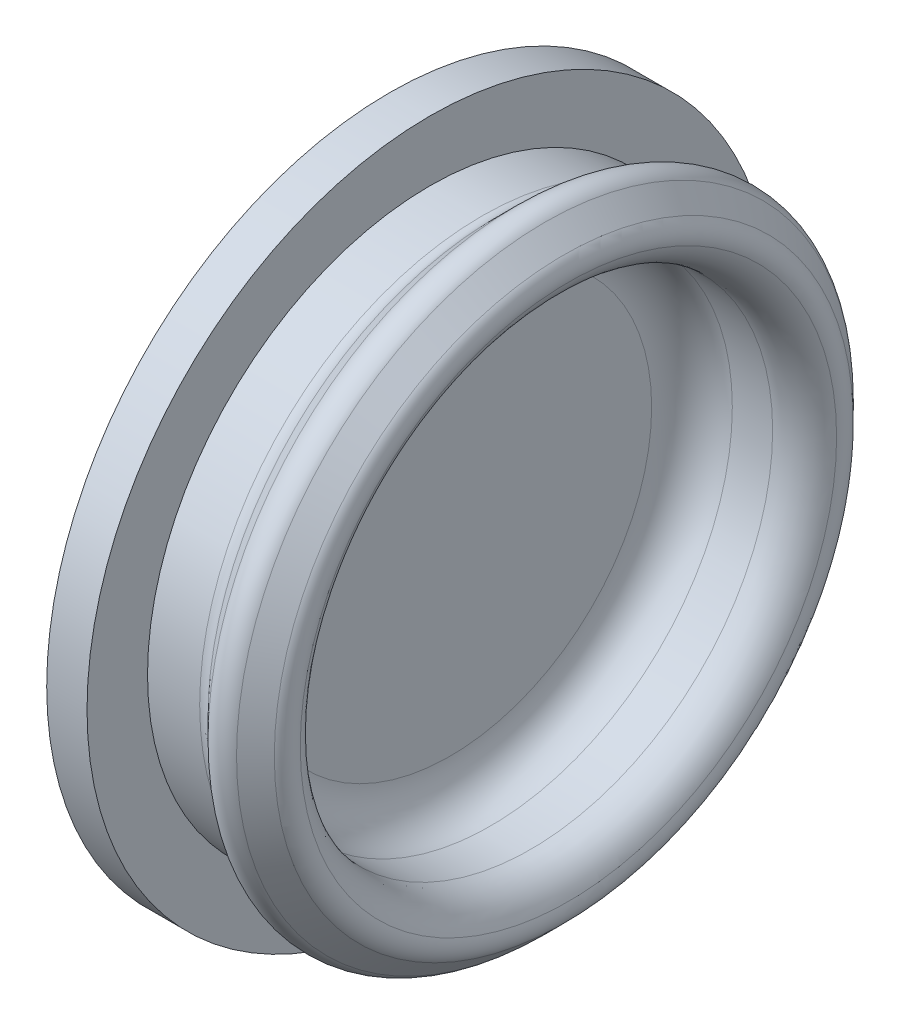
ISO-10303-21;
HEADER;
FILE_DESCRIPTION(('STEP AP214'),'2;1');
FILE_NAME('part.step','',(''),(''),'','','');
FILE_SCHEMA(('AUTOMOTIVE_DESIGN { 1 0 10303 214 1 1 1 1 }'));
ENDSEC;
DATA;
#1=APPLICATION_CONTEXT('core data for automotive mechanical design processes');
#2=APPLICATION_PROTOCOL_DEFINITION('international standard','automotive_design',2000,#1);
#3=PRODUCT_CONTEXT('',#1,'mechanical');
#4=PRODUCT('Part','Part','',(#3));
#5=PRODUCT_RELATED_PRODUCT_CATEGORY('part','',(#4));
#6=PRODUCT_DEFINITION_FORMATION('','',#4);
#7=PRODUCT_DEFINITION_CONTEXT('part definition',#1,'design');
#8=PRODUCT_DEFINITION('design','',#6,#7);
#9=PRODUCT_DEFINITION_SHAPE('','',#8);
#10=(LENGTH_UNIT() NAMED_UNIT(*) SI_UNIT(.MILLI.,.METRE.));
#11=(NAMED_UNIT(*) PLANE_ANGLE_UNIT() SI_UNIT($,.RADIAN.));
#12=(NAMED_UNIT(*) SI_UNIT($,.STERADIAN.) SOLID_ANGLE_UNIT());
#13=UNCERTAINTY_MEASURE_WITH_UNIT(LENGTH_MEASURE(1.E-05),#10,'distance_accuracy_value','');
#14=(GEOMETRIC_REPRESENTATION_CONTEXT(3) GLOBAL_UNCERTAINTY_ASSIGNED_CONTEXT((#13)) GLOBAL_UNIT_ASSIGNED_CONTEXT((#10,
#11,#12)) REPRESENTATION_CONTEXT('',''));
#15=CARTESIAN_POINT('',(0.,0.,0.));
#16=DIRECTION('',(0.,0.,1.));
#17=DIRECTION('',(1.,0.,0.));
#18=AXIS2_PLACEMENT_3D('',#15,#16,#17);
#19=CARTESIAN_POINT('',(-98.2502746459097,31.6895515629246,62.9087422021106));
#20=DIRECTION('',(-1.,0.,0.));
#21=DIRECTION('',(0.,-1.,0.));
#22=AXIS2_PLACEMENT_3D('',#19,#20,#21);
#23=CYLINDRICAL_SURFACE('',#22,7.);
#24=CARTESIAN_POINT('',(-98.4573814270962,31.6895515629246,62.9087422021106));
#25=DIRECTION('',(1.,0.,0.));
#26=DIRECTION('',(0.,1.,0.));
#27=AXIS2_PLACEMENT_3D('',#24,#25,#26);
#28=CIRCLE('',#27,7.);
#29=CARTESIAN_POINT('',(-98.4573814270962,38.6895515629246,62.9087422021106));
#30=VERTEX_POINT('',#29);
#31=EDGE_CURVE('E10',#30,#30,#28,.F.);
#32=ORIENTED_EDGE('',*,*,#31,.T.);
#33=EDGE_LOOP('',(#32));
#34=FACE_BOUND('',#33,.T.);
#35=CARTESIAN_POINT('',(-99.7502746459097,31.6895515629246,62.9087422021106));
#36=DIRECTION('',(-1.,0.,0.));
#37=DIRECTION('',(0.,-1.,0.));
#38=AXIS2_PLACEMENT_3D('',#35,#36,#37);
#39=CIRCLE('',#38,7.);
#40=CARTESIAN_POINT('',(-99.7502746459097,24.6895515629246,62.9087422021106));
#41=VERTEX_POINT('',#40);
#42=EDGE_CURVE('E70',#41,#41,#39,.T.);
#43=ORIENTED_EDGE('',*,*,#42,.F.);
#44=EDGE_LOOP('',(#43));
#45=FACE_BOUND('',#44,.T.);
#46=ADVANCED_FACE('F35',(#34,#45),#23,.T.);
#47=CARTESIAN_POINT('',(-100.75027464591,31.6895515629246,62.9087422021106));
#48=DIRECTION('',(1.,0.,0.));
#49=DIRECTION('',(0.,1.,0.));
#50=AXIS2_PLACEMENT_3D('',#47,#48,#49);
#51=CYLINDRICAL_SURFACE('',#50,8.50000000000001);
#52=CARTESIAN_POINT('',(-100.75027464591,31.6895515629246,62.9087422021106));
#53=DIRECTION('',(-1.,0.,0.));
#54=DIRECTION('',(0.,-1.,0.));
#55=AXIS2_PLACEMENT_3D('',#52,#53,#54);
#56=CIRCLE('',#55,8.50000000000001);
#57=CARTESIAN_POINT('',(-100.75027464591,23.1895515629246,62.9087422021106));
#58=VERTEX_POINT('',#57);
#59=EDGE_CURVE('E73',#58,#58,#56,.T.);
#60=ORIENTED_EDGE('',*,*,#59,.F.);
#61=EDGE_LOOP('',(#60));
#62=FACE_BOUND('',#61,.T.);
#63=CARTESIAN_POINT('',(-99.7502746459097,31.6895515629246,62.9087422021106));
#64=DIRECTION('',(-1.,0.,0.));
#65=DIRECTION('',(0.,-1.,0.));
#66=AXIS2_PLACEMENT_3D('',#63,#64,#65);
#67=CIRCLE('',#66,8.50000000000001);
#68=CARTESIAN_POINT('',(-99.7502746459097,23.1895515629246,62.9087422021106));
#69=VERTEX_POINT('',#68);
#70=EDGE_CURVE('E74',#69,#69,#67,.T.);
#71=ORIENTED_EDGE('',*,*,#70,.T.);
#72=EDGE_LOOP('',(#71));
#73=FACE_BOUND('',#72,.T.);
#74=ADVANCED_FACE('F82',(#62,#73),#51,.T.);
#75=CARTESIAN_POINT('',(-100.75027464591,31.6895515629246,62.9087422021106));
#76=DIRECTION('',(-1.,0.,0.));
#77=DIRECTION('',(0.,-1.,0.));
#78=AXIS2_PLACEMENT_3D('',#75,#76,#77);
#79=PLANE('',#78);
#80=ORIENTED_EDGE('',*,*,#59,.T.);
#81=EDGE_LOOP('',(#80));
#82=FACE_BOUND('',#81,.T.);
#83=ADVANCED_FACE('F80',(#82),#79,.T.);
#84=CARTESIAN_POINT('',(-99.7502746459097,31.6895515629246,62.9087422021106));
#85=DIRECTION('',(-1.,0.,0.));
#86=DIRECTION('',(0.,-1.,0.));
#87=AXIS2_PLACEMENT_3D('',#84,#85,#86);
#88=PLANE('',#87);
#89=ORIENTED_EDGE('',*,*,#42,.T.);
#90=EDGE_LOOP('',(#89));
#91=FACE_BOUND('',#90,.T.);
#92=ORIENTED_EDGE('',*,*,#70,.F.);
#93=EDGE_LOOP('',(#92));
#94=FACE_BOUND('',#93,.T.);
#95=ADVANCED_FACE('F88',(#91,#94),#88,.F.);
#96=CARTESIAN_POINT('',(-97.2502746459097,31.6895515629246,62.9087422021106));
#97=DIRECTION('',(-1.,0.,0.));
#98=DIRECTION('',(0.,0.,1.));
#99=AXIS2_PLACEMENT_3D('',#96,#97,#98);
#100=CONICAL_SURFACE('',#99,8.,0.785398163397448);
#101=CARTESIAN_POINT('',(-96.4284775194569,31.6895515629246,62.9087422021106));
#102=DIRECTION('',(-1.,0.,0.));
#103=DIRECTION('',(0.,0.,1.));
#104=AXIS2_PLACEMENT_3D('',#101,#102,#103);
#105=CIRCLE('',#104,7.17820287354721);
#106=CARTESIAN_POINT('',(-96.4284775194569,31.6895515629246,70.0869450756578));
#107=VERTEX_POINT('',#106);
#108=EDGE_CURVE('E50',#107,#107,#105,.T.);
#109=ORIENTED_EDGE('',*,*,#108,.T.);
#110=EDGE_LOOP('',(#109));
#111=FACE_BOUND('',#110,.T.);
#112=CARTESIAN_POINT('',(-96.8967212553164,31.6895515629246,62.9087422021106));
#113=DIRECTION('',(1.,0.,0.));
#114=DIRECTION('',(0.,0.,-1.));
#115=AXIS2_PLACEMENT_3D('',#112,#113,#114);
#116=CIRCLE('',#115,7.64644660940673);
#117=CARTESIAN_POINT('',(-96.8967212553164,31.6895515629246,55.2622955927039));
#118=VERTEX_POINT('',#117);
#119=EDGE_CURVE('E55',#118,#118,#116,.T.);
#120=ORIENTED_EDGE('',*,*,#119,.T.);
#121=EDGE_LOOP('',(#120));
#122=FACE_BOUND('',#121,.T.);
#123=ADVANCED_FACE('F90',(#111,#122),#100,.T.);
#124=CARTESIAN_POINT('',(-98.2502746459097,31.6895515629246,62.9087422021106));
#125=DIRECTION('',(1.,0.,0.));
#126=DIRECTION('',(0.,0.,-1.));
#127=AXIS2_PLACEMENT_3D('',#124,#125,#126);
#128=CONICAL_SURFACE('',#127,7.,0.785398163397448);
#129=CARTESIAN_POINT('',(-98.103828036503,31.6895515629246,62.9087422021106));
#130=DIRECTION('',(-1.,0.,0.));
#131=DIRECTION('',(0.,-1.,0.));
#132=AXIS2_PLACEMENT_3D('',#129,#130,#131);
#133=CIRCLE('',#132,7.14644660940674);
#134=CARTESIAN_POINT('',(-98.103828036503,24.5431049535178,62.9087422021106));
#135=VERTEX_POINT('',#134);
#136=EDGE_CURVE('E42',#135,#135,#133,.F.);
#137=ORIENTED_EDGE('',*,*,#136,.T.);
#138=EDGE_LOOP('',(#137));
#139=FACE_BOUND('',#138,.T.);
#140=CARTESIAN_POINT('',(-97.603828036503,31.6895515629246,62.9087422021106));
#141=DIRECTION('',(-1.,0.,0.));
#142=DIRECTION('',(0.,0.,1.));
#143=AXIS2_PLACEMENT_3D('',#140,#141,#142);
#144=CIRCLE('',#143,7.64644660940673);
#145=CARTESIAN_POINT('',(-97.603828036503,31.6895515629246,70.5551888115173));
#146=VERTEX_POINT('',#145);
#147=EDGE_CURVE('E46',#146,#146,#144,.T.);
#148=ORIENTED_EDGE('',*,*,#147,.T.);
#149=EDGE_LOOP('',(#148));
#150=FACE_BOUND('',#149,.T.);
#151=ADVANCED_FACE('F98',(#139,#150),#128,.T.);
#152=CARTESIAN_POINT('',(-99.2502746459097,31.6895515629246,62.9087422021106));
#153=DIRECTION('',(1.,0.,0.));
#154=DIRECTION('',(0.,0.,-1.));
#155=AXIS2_PLACEMENT_3D('',#152,#153,#154);
#156=CYLINDRICAL_SURFACE('',#155,6.);
#157=CARTESIAN_POINT('',(-98.2502746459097,31.6895515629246,62.9087422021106));
#158=DIRECTION('',(1.,0.,0.));
#159=DIRECTION('',(0.,0.,-1.));
#160=AXIS2_PLACEMENT_3D('',#157,#158,#159);
#161=CIRCLE('',#160,6.);
#162=CARTESIAN_POINT('',(-98.2502746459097,31.6895515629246,56.9087422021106));
#163=VERTEX_POINT('',#162);
#164=EDGE_CURVE('E61',#163,#163,#161,.F.);
#165=ORIENTED_EDGE('',*,*,#164,.T.);
#166=EDGE_LOOP('',(#165));
#167=FACE_BOUND('',#166,.T.);
#168=CARTESIAN_POINT('',(-97.2502746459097,31.6895515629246,62.9087422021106));
#169=DIRECTION('',(-1.,0.,0.));
#170=DIRECTION('',(0.,0.,1.));
#171=AXIS2_PLACEMENT_3D('',#168,#169,#170);
#172=CIRCLE('',#171,6.);
#173=CARTESIAN_POINT('',(-97.2502746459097,31.6895515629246,68.9087422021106));
#174=VERTEX_POINT('',#173);
#175=EDGE_CURVE('E64',#174,#174,#172,.F.);
#176=ORIENTED_EDGE('',*,*,#175,.T.);
#177=EDGE_LOOP('',(#176));
#178=FACE_BOUND('',#177,.T.);
#179=ADVANCED_FACE('F137',(#167,#178),#156,.F.);
#180=CARTESIAN_POINT('',(-99.2502746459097,31.6895515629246,62.9087422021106));
#181=DIRECTION('',(1.,0.,0.));
#182=DIRECTION('',(0.,0.,-1.));
#183=AXIS2_PLACEMENT_3D('',#180,#181,#182);
#184=PLANE('',#183);
#185=CARTESIAN_POINT('',(-99.2502746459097,31.6895515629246,62.9087422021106));
#186=DIRECTION('',(1.,0.,0.));
#187=DIRECTION('',(0.,0.,-1.));
#188=AXIS2_PLACEMENT_3D('',#185,#186,#187);
#189=CIRCLE('',#188,5.);
#190=CARTESIAN_POINT('',(-99.2502746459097,31.6895515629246,57.9087422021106));
#191=VERTEX_POINT('',#190);
#192=EDGE_CURVE('E67',#191,#191,#189,.T.);
#193=ORIENTED_EDGE('',*,*,#192,.T.);
#194=EDGE_LOOP('',(#193));
#195=FACE_BOUND('',#194,.T.);
#196=ADVANCED_FACE('F113',(#195),#184,.T.);
#197=CARTESIAN_POINT('',(-98.2502746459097,31.6895515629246,62.9087422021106));
#198=DIRECTION('',(1.,0.,0.));
#199=DIRECTION('',(0.,0.,-1.));
#200=AXIS2_PLACEMENT_3D('',#197,#198,#199);
#201=TOROIDAL_SURFACE('',#200,5.,1.);
#202=ORIENTED_EDGE('',*,*,#164,.F.);
#203=EDGE_LOOP('',(#202));
#204=FACE_BOUND('',#203,.T.);
#205=ORIENTED_EDGE('',*,*,#192,.F.);
#206=EDGE_LOOP('',(#205));
#207=FACE_BOUND('',#206,.T.);
#208=ADVANCED_FACE('F109',(#204,#207),#201,.F.);
#209=CARTESIAN_POINT('',(-97.2502746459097,31.6895515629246,62.9087422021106));
#210=DIRECTION('',(-1.,0.,0.));
#211=DIRECTION('',(0.,0.,1.));
#212=AXIS2_PLACEMENT_3D('',#209,#210,#211);
#213=TOROIDAL_SURFACE('',#212,7.,1.);
#214=CARTESIAN_POINT('',(-96.3137871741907,31.6895515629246,62.9087422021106));
#215=DIRECTION('',(-1.,0.,0.));
#216=DIRECTION('',(0.,0.,1.));
#217=AXIS2_PLACEMENT_3D('',#214,#215,#216);
#218=CIRCLE('',#217,6.64929896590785);
#219=CARTESIAN_POINT('',(-96.3137871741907,31.6895515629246,69.5580411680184));
#220=VERTEX_POINT('',#219);
#221=EDGE_CURVE('E58',#220,#220,#218,.F.);
#222=ORIENTED_EDGE('',*,*,#221,.T.);
#223=EDGE_LOOP('',(#222));
#224=FACE_BOUND('',#223,.T.);
#225=ORIENTED_EDGE('',*,*,#175,.F.);
#226=EDGE_LOOP('',(#225));
#227=FACE_BOUND('',#226,.T.);
#228=ADVANCED_FACE('F112',(#224,#227),#213,.T.);
#229=CARTESIAN_POINT('',(-96.7820309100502,31.6895515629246,62.9087422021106));
#230=DIRECTION('',(-1.,0.,0.));
#231=DIRECTION('',(0.,0.,1.));
#232=AXIS2_PLACEMENT_3D('',#229,#230,#231);
#233=TOROIDAL_SURFACE('',#232,6.82464948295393,0.5);
#234=ORIENTED_EDGE('',*,*,#108,.F.);
#235=EDGE_LOOP('',(#234));
#236=FACE_BOUND('',#235,.T.);
#237=ORIENTED_EDGE('',*,*,#221,.F.);
#238=EDGE_LOOP('',(#237));
#239=FACE_BOUND('',#238,.T.);
#240=ADVANCED_FACE('F117',(#236,#239),#233,.T.);
#241=CARTESIAN_POINT('',(-98.4573814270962,31.6895515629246,62.9087422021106));
#242=DIRECTION('',(1.,0.,0.));
#243=DIRECTION('',(0.,1.,0.));
#244=AXIS2_PLACEMENT_3D('',#241,#242,#243);
#245=TOROIDAL_SURFACE('',#244,7.50000000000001,0.5);
#246=ORIENTED_EDGE('',*,*,#31,.F.);
#247=EDGE_LOOP('',(#246));
#248=FACE_BOUND('',#247,.T.);
#249=ORIENTED_EDGE('',*,*,#136,.F.);
#250=EDGE_LOOP('',(#249));
#251=FACE_BOUND('',#250,.T.);
#252=ADVANCED_FACE('F120',(#248,#251),#245,.F.);
#253=CARTESIAN_POINT('',(-97.2502746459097,31.6895515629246,62.9087422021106));
#254=DIRECTION('',(-1.,0.,0.));
#255=DIRECTION('',(0.,0.,1.));
#256=AXIS2_PLACEMENT_3D('',#253,#254,#255);
#257=TOROIDAL_SURFACE('',#256,7.29289321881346,0.5);
#258=ORIENTED_EDGE('',*,*,#147,.F.);
#259=EDGE_LOOP('',(#258));
#260=FACE_BOUND('',#259,.T.);
#261=ORIENTED_EDGE('',*,*,#119,.F.);
#262=EDGE_LOOP('',(#261));
#263=FACE_BOUND('',#262,.T.);
#264=ADVANCED_FACE('F37',(#260,#263),#257,.T.);
#265=CLOSED_SHELL('',(#46,#74,#83,#95,#123,#151,#179,#196,#208,#228,#240,#252,#264));
#266=MANIFOLD_SOLID_BREP('B2',#265);
#267=ADVANCED_BREP_SHAPE_REPRESENTATION('',(#18,#266),#14);
#268=SHAPE_DEFINITION_REPRESENTATION(#9,#267);
ENDSEC;
END-ISO-10303-21;
